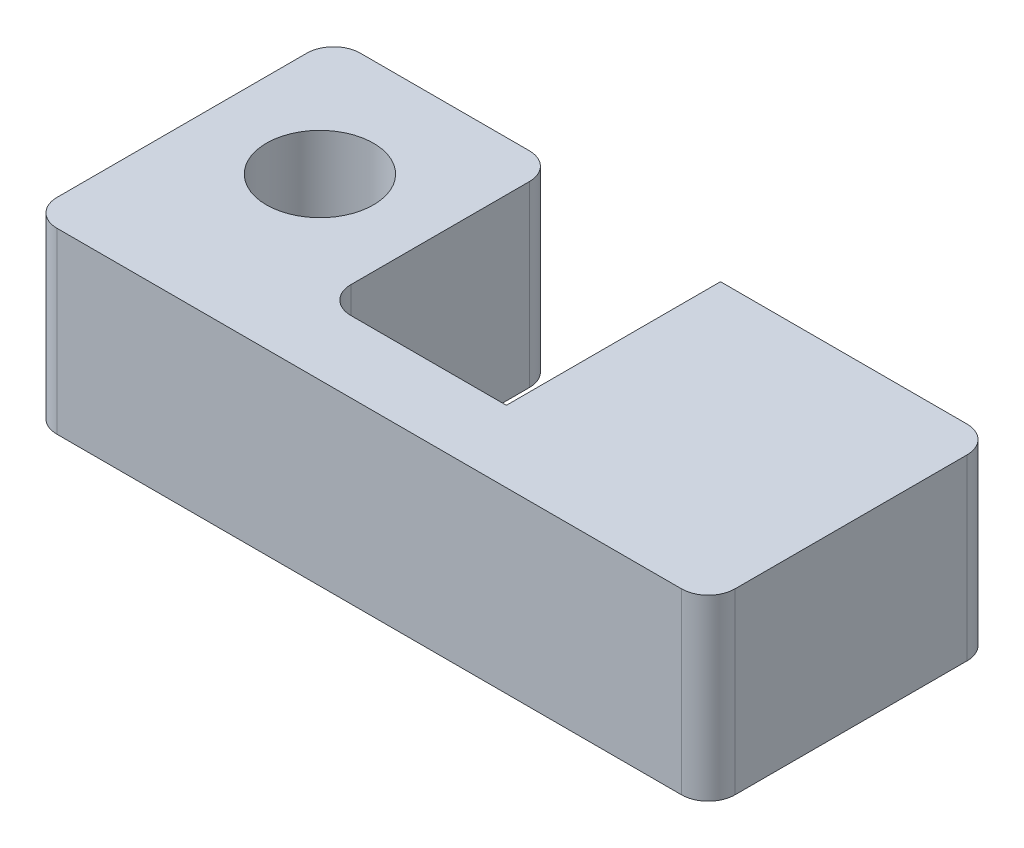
ISO-10303-21;
HEADER;
FILE_DESCRIPTION(('STEP AP214'),'2;1');
FILE_NAME('part.step','',(''),(''),'','','');
FILE_SCHEMA(('AUTOMOTIVE_DESIGN { 1 0 10303 214 1 1 1 1 }'));
ENDSEC;
DATA;
#1=APPLICATION_CONTEXT('core data for automotive mechanical design processes');
#2=APPLICATION_PROTOCOL_DEFINITION('international standard','automotive_design',2000,#1);
#3=PRODUCT_CONTEXT('',#1,'mechanical');
#4=PRODUCT('Part','Part','',(#3));
#5=PRODUCT_RELATED_PRODUCT_CATEGORY('part','',(#4));
#6=PRODUCT_DEFINITION_FORMATION('','',#4);
#7=PRODUCT_DEFINITION_CONTEXT('part definition',#1,'design');
#8=PRODUCT_DEFINITION('design','',#6,#7);
#9=PRODUCT_DEFINITION_SHAPE('','',#8);
#10=(LENGTH_UNIT() NAMED_UNIT(*) SI_UNIT(.MILLI.,.METRE.));
#11=(NAMED_UNIT(*) PLANE_ANGLE_UNIT() SI_UNIT($,.RADIAN.));
#12=(NAMED_UNIT(*) SI_UNIT($,.STERADIAN.) SOLID_ANGLE_UNIT());
#13=UNCERTAINTY_MEASURE_WITH_UNIT(LENGTH_MEASURE(1.E-05),#10,'distance_accuracy_value','');
#14=(GEOMETRIC_REPRESENTATION_CONTEXT(3) GLOBAL_UNCERTAINTY_ASSIGNED_CONTEXT((#13)) GLOBAL_UNIT_ASSIGNED_CONTEXT((#10,
#11,#12)) REPRESENTATION_CONTEXT('',''));
#15=CARTESIAN_POINT('',(0.,0.,0.));
#16=DIRECTION('',(0.,0.,1.));
#17=DIRECTION('',(1.,0.,0.));
#18=AXIS2_PLACEMENT_3D('',#15,#16,#17);
#19=CARTESIAN_POINT('',(7.735,-10.,4.5));
#20=DIRECTION('',(0.,1.,0.));
#21=DIRECTION('',(0.,0.,1.));
#22=AXIS2_PLACEMENT_3D('',#19,#20,#21);
#23=CYLINDRICAL_SURFACE('',#22,1.5);
#24=CARTESIAN_POINT('',(7.735,0.,4.5));
#25=DIRECTION('',(0.,-1.,0.));
#26=DIRECTION('',(0.,0.,1.));
#27=AXIS2_PLACEMENT_3D('',#24,#25,#26);
#28=CIRCLE('',#27,1.5);
#29=CARTESIAN_POINT('',(7.735,0.,6.));
#30=VERTEX_POINT('',#29);
#31=CARTESIAN_POINT('',(6.235,0.,4.5));
#32=VERTEX_POINT('',#31);
#33=EDGE_CURVE('E170',#30,#32,#28,.T.);
#34=ORIENTED_EDGE('',*,*,#33,.F.);
#35=DIRECTION('',(0.,1.,0.));
#36=VECTOR('',#35,1.);
#37=CARTESIAN_POINT('',(7.735,-10.,6.));
#38=LINE('',#37,#36);
#39=CARTESIAN_POINT('',(7.735,-10.,6.));
#40=VERTEX_POINT('',#39);
#41=EDGE_CURVE('E11',#40,#30,#38,.T.);
#42=ORIENTED_EDGE('',*,*,#41,.F.);
#43=CARTESIAN_POINT('',(7.735,-10.,4.5));
#44=DIRECTION('',(0.,-1.,0.));
#45=DIRECTION('',(0.,0.,1.));
#46=AXIS2_PLACEMENT_3D('',#43,#44,#45);
#47=CIRCLE('',#46,1.5);
#48=CARTESIAN_POINT('',(6.235,-10.,4.5));
#49=VERTEX_POINT('',#48);
#50=EDGE_CURVE('E209',#40,#49,#47,.T.);
#51=ORIENTED_EDGE('',*,*,#50,.T.);
#52=DIRECTION('',(0.,1.,0.));
#53=VECTOR('',#52,1.);
#54=CARTESIAN_POINT('',(6.235,-10.,4.5));
#55=LINE('',#54,#53);
#56=EDGE_CURVE('E34',#49,#32,#55,.T.);
#57=ORIENTED_EDGE('',*,*,#56,.T.);
#58=EDGE_LOOP('',(#34,#42,#51,#57));
#59=FACE_BOUND('',#58,.T.);
#60=ADVANCED_FACE('F31',(#59),#23,.F.);
#61=CARTESIAN_POINT('',(7.735,-10.,6.));
#62=DIRECTION('',(0.,0.,-1.));
#63=DIRECTION('',(-1.,0.,0.));
#64=AXIS2_PLACEMENT_3D('',#61,#62,#63);
#65=PLANE('',#64);
#66=DIRECTION('',(-1.,0.,0.));
#67=VECTOR('',#66,1.);
#68=CARTESIAN_POINT('',(7.735,0.,6.));
#69=LINE('',#68,#67);
#70=CARTESIAN_POINT('',(16.45,0.,6.));
#71=VERTEX_POINT('',#70);
#72=EDGE_CURVE('E207',#71,#30,#69,.T.);
#73=ORIENTED_EDGE('',*,*,#72,.F.);
#74=DIRECTION('',(0.,1.,0.));
#75=VECTOR('',#74,1.);
#76=CARTESIAN_POINT('',(16.45,-10.,6.));
#77=LINE('',#76,#75);
#78=CARTESIAN_POINT('',(16.45,-0.999999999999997,6.));
#79=VERTEX_POINT('',#78);
#80=EDGE_CURVE('E39',#79,#71,#77,.T.);
#81=ORIENTED_EDGE('',*,*,#80,.F.);
#82=DIRECTION('',(-0.788800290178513,0.614649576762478,0.));
#83=VECTOR('',#82,1.);
#84=CARTESIAN_POINT('',(16.45,-1.,6.));
#85=LINE('',#84,#83);
#86=CARTESIAN_POINT('',(28.,-10.,6.));
#87=VERTEX_POINT('',#86);
#88=EDGE_CURVE('E237',#87,#79,#85,.T.);
#89=ORIENTED_EDGE('',*,*,#88,.F.);
#90=DIRECTION('',(-1.,0.,0.));
#91=VECTOR('',#90,1.);
#92=CARTESIAN_POINT('',(7.735,-10.,6.));
#93=LINE('',#92,#91);
#94=EDGE_CURVE('E47',#87,#40,#93,.T.);
#95=ORIENTED_EDGE('',*,*,#94,.T.);
#96=ORIENTED_EDGE('',*,*,#41,.T.);
#97=EDGE_LOOP('',(#73,#81,#89,#95,#96));
#98=FACE_BOUND('',#97,.T.);
#99=ADVANCED_FACE('F234',(#98),#65,.T.);
#100=CARTESIAN_POINT('',(16.45,-10.,6.));
#101=DIRECTION('',(-1.,0.,0.));
#102=DIRECTION('',(0.,0.,1.));
#103=AXIS2_PLACEMENT_3D('',#100,#101,#102);
#104=PLANE('',#103);
#105=DIRECTION('',(0.,0.,-1.));
#106=VECTOR('',#105,1.);
#107=CARTESIAN_POINT('',(16.45,-1.,20.6424895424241));
#108=LINE('',#107,#106);
#109=CARTESIAN_POINT('',(16.45,-1.,-6.));
#110=VERTEX_POINT('',#109);
#111=EDGE_CURVE('E246',#79,#110,#108,.T.);
#112=ORIENTED_EDGE('',*,*,#111,.F.);
#113=ORIENTED_EDGE('',*,*,#80,.T.);
#114=DIRECTION('',(0.,0.,1.));
#115=VECTOR('',#114,1.);
#116=CARTESIAN_POINT('',(16.45,0.,6.));
#117=LINE('',#116,#115);
#118=CARTESIAN_POINT('',(16.45,0.,-6.));
#119=VERTEX_POINT('',#118);
#120=EDGE_CURVE('E204',#119,#71,#117,.T.);
#121=ORIENTED_EDGE('',*,*,#120,.F.);
#122=DIRECTION('',(0.,1.,0.));
#123=VECTOR('',#122,1.);
#124=CARTESIAN_POINT('',(16.45,-10.,-6.));
#125=LINE('',#124,#123);
#126=EDGE_CURVE('E212',#110,#119,#125,.T.);
#127=ORIENTED_EDGE('',*,*,#126,.F.);
#128=EDGE_LOOP('',(#112,#113,#121,#127));
#129=FACE_BOUND('',#128,.T.);
#130=ADVANCED_FACE('F243',(#129),#104,.T.);
#131=CARTESIAN_POINT('',(16.45,-10.,-6.));
#132=DIRECTION('',(0.,0.,-1.));
#133=DIRECTION('',(-1.,0.,0.));
#134=AXIS2_PLACEMENT_3D('',#131,#132,#133);
#135=PLANE('',#134);
#136=DIRECTION('',(0.788800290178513,-0.614649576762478,0.));
#137=VECTOR('',#136,1.);
#138=CARTESIAN_POINT('',(20.8135218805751,-4.40014691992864,-6.));
#139=LINE('',#138,#137);
#140=CARTESIAN_POINT('',(28.,-10.,-6.));
#141=VERTEX_POINT('',#140);
#142=EDGE_CURVE('E255',#110,#141,#139,.T.);
#143=ORIENTED_EDGE('',*,*,#142,.F.);
#144=ORIENTED_EDGE('',*,*,#126,.T.);
#145=DIRECTION('',(-1.,0.,0.));
#146=VECTOR('',#145,1.);
#147=CARTESIAN_POINT('',(16.45,0.,-6.));
#148=LINE('',#147,#146);
#149=CARTESIAN_POINT('',(30.265,0.,-6.));
#150=VERTEX_POINT('',#149);
#151=EDGE_CURVE('E201',#150,#119,#148,.T.);
#152=ORIENTED_EDGE('',*,*,#151,.F.);
#153=DIRECTION('',(0.,1.,0.));
#154=VECTOR('',#153,1.);
#155=CARTESIAN_POINT('',(30.265,-10.,-6.));
#156=LINE('',#155,#154);
#157=CARTESIAN_POINT('',(30.265,-10.,-6.));
#158=VERTEX_POINT('',#157);
#159=EDGE_CURVE('E149',#158,#150,#156,.T.);
#160=ORIENTED_EDGE('',*,*,#159,.F.);
#161=DIRECTION('',(-1.,0.,0.));
#162=VECTOR('',#161,1.);
#163=CARTESIAN_POINT('',(16.45,-10.,-6.));
#164=LINE('',#163,#162);
#165=EDGE_CURVE('E159',#158,#141,#164,.T.);
#166=ORIENTED_EDGE('',*,*,#165,.T.);
#167=EDGE_LOOP('',(#143,#144,#152,#160,#166));
#168=FACE_BOUND('',#167,.T.);
#169=ADVANCED_FACE('F322',(#168),#135,.T.);
#170=CARTESIAN_POINT('',(30.265,-10.,-4.5));
#171=DIRECTION('',(0.,1.,0.));
#172=DIRECTION('',(0.,0.,1.));
#173=AXIS2_PLACEMENT_3D('',#170,#171,#172);
#174=CYLINDRICAL_SURFACE('',#173,1.5);
#175=CARTESIAN_POINT('',(30.265,0.,-4.5));
#176=DIRECTION('',(0.,1.,0.));
#177=DIRECTION('',(0.,0.,-1.));
#178=AXIS2_PLACEMENT_3D('',#175,#176,#177);
#179=CIRCLE('',#178,1.5);
#180=CARTESIAN_POINT('',(31.765,0.,-4.5));
#181=VERTEX_POINT('',#180);
#182=EDGE_CURVE('E144',#181,#150,#179,.T.);
#183=ORIENTED_EDGE('',*,*,#182,.F.);
#184=DIRECTION('',(0.,1.,0.));
#185=VECTOR('',#184,1.);
#186=CARTESIAN_POINT('',(31.765,-10.,-4.5));
#187=LINE('',#186,#185);
#188=CARTESIAN_POINT('',(31.765,-10.,-4.5));
#189=VERTEX_POINT('',#188);
#190=EDGE_CURVE('E139',#189,#181,#187,.T.);
#191=ORIENTED_EDGE('',*,*,#190,.F.);
#192=CARTESIAN_POINT('',(30.265,-10.,-4.5));
#193=DIRECTION('',(0.,1.,0.));
#194=DIRECTION('',(0.,0.,-1.));
#195=AXIS2_PLACEMENT_3D('',#192,#193,#194);
#196=CIRCLE('',#195,1.5);
#197=EDGE_CURVE('E142',#189,#158,#196,.T.);
#198=ORIENTED_EDGE('',*,*,#197,.T.);
#199=ORIENTED_EDGE('',*,*,#159,.T.);
#200=EDGE_LOOP('',(#183,#191,#198,#199));
#201=FACE_BOUND('',#200,.T.);
#202=ADVANCED_FACE('F141',(#201),#174,.T.);
#203=CARTESIAN_POINT('',(31.765,-10.,-4.5));
#204=DIRECTION('',(1.,0.,0.));
#205=DIRECTION('',(0.,0.,-1.));
#206=AXIS2_PLACEMENT_3D('',#203,#204,#205);
#207=PLANE('',#206);
#208=DIRECTION('',(0.,0.,-1.));
#209=VECTOR('',#208,1.);
#210=CARTESIAN_POINT('',(31.765,0.,-4.5));
#211=LINE('',#210,#209);
#212=CARTESIAN_POINT('',(31.765,0.,8.49999999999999));
#213=VERTEX_POINT('',#212);
#214=EDGE_CURVE('E198',#213,#181,#211,.T.);
#215=ORIENTED_EDGE('',*,*,#214,.F.);
#216=DIRECTION('',(0.,1.,0.));
#217=VECTOR('',#216,1.);
#218=CARTESIAN_POINT('',(31.765,-10.,8.49999999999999));
#219=LINE('',#218,#217);
#220=CARTESIAN_POINT('',(31.765,-10.,8.49999999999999));
#221=VERTEX_POINT('',#220);
#222=EDGE_CURVE('E150',#221,#213,#219,.T.);
#223=ORIENTED_EDGE('',*,*,#222,.F.);
#224=DIRECTION('',(0.,0.,-1.));
#225=VECTOR('',#224,1.);
#226=CARTESIAN_POINT('',(31.765,-10.,-4.5));
#227=LINE('',#226,#225);
#228=EDGE_CURVE('E156',#221,#189,#227,.T.);
#229=ORIENTED_EDGE('',*,*,#228,.T.);
#230=ORIENTED_EDGE('',*,*,#190,.T.);
#231=EDGE_LOOP('',(#215,#223,#229,#230));
#232=FACE_BOUND('',#231,.T.);
#233=ADVANCED_FACE('F161',(#232),#207,.T.);
#234=CARTESIAN_POINT('',(30.265,-10.,8.49999999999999));
#235=DIRECTION('',(0.,1.,0.));
#236=DIRECTION('',(0.,0.,1.));
#237=AXIS2_PLACEMENT_3D('',#234,#235,#236);
#238=CYLINDRICAL_SURFACE('',#237,1.5);
#239=CARTESIAN_POINT('',(30.265,0.,8.49999999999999));
#240=DIRECTION('',(0.,1.,0.));
#241=DIRECTION('',(0.,0.,-1.));
#242=AXIS2_PLACEMENT_3D('',#239,#240,#241);
#243=CIRCLE('',#242,1.5);
#244=CARTESIAN_POINT('',(30.265,0.,9.99999999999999));
#245=VERTEX_POINT('',#244);
#246=EDGE_CURVE('E195',#245,#213,#243,.T.);
#247=ORIENTED_EDGE('',*,*,#246,.F.);
#248=DIRECTION('',(0.,1.,0.));
#249=VECTOR('',#248,1.);
#250=CARTESIAN_POINT('',(30.265,-10.,9.99999999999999));
#251=LINE('',#250,#249);
#252=CARTESIAN_POINT('',(30.265,-10.,9.99999999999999));
#253=VERTEX_POINT('',#252);
#254=EDGE_CURVE('E216',#253,#245,#251,.T.);
#255=ORIENTED_EDGE('',*,*,#254,.F.);
#256=CARTESIAN_POINT('',(30.265,-10.,8.49999999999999));
#257=DIRECTION('',(0.,1.,0.));
#258=DIRECTION('',(0.,0.,-1.));
#259=AXIS2_PLACEMENT_3D('',#256,#257,#258);
#260=CIRCLE('',#259,1.5);
#261=EDGE_CURVE('E162',#253,#221,#260,.T.);
#262=ORIENTED_EDGE('',*,*,#261,.T.);
#263=ORIENTED_EDGE('',*,*,#222,.T.);
#264=EDGE_LOOP('',(#247,#255,#262,#263));
#265=FACE_BOUND('',#264,.T.);
#266=ADVANCED_FACE('F305',(#265),#238,.T.);
#267=CARTESIAN_POINT('',(30.265,-10.,9.99999999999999));
#268=DIRECTION('',(0.,0.,1.));
#269=DIRECTION('',(1.,0.,0.));
#270=AXIS2_PLACEMENT_3D('',#267,#268,#269);
#271=PLANE('',#270);
#272=DIRECTION('',(1.,0.,0.));
#273=VECTOR('',#272,1.);
#274=CARTESIAN_POINT('',(30.265,0.,9.99999999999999));
#275=LINE('',#274,#273);
#276=CARTESIAN_POINT('',(-4.735,0.,10.));
#277=VERTEX_POINT('',#276);
#278=EDGE_CURVE('E192',#277,#245,#275,.T.);
#279=ORIENTED_EDGE('',*,*,#278,.F.);
#280=DIRECTION('',(0.,1.,0.));
#281=VECTOR('',#280,1.);
#282=CARTESIAN_POINT('',(-4.735,-10.,10.));
#283=LINE('',#282,#281);
#284=CARTESIAN_POINT('',(-4.735,-10.,10.));
#285=VERTEX_POINT('',#284);
#286=EDGE_CURVE('E218',#285,#277,#283,.T.);
#287=ORIENTED_EDGE('',*,*,#286,.F.);
#288=DIRECTION('',(1.,0.,0.));
#289=VECTOR('',#288,1.);
#290=CARTESIAN_POINT('',(30.265,-10.,9.99999999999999));
#291=LINE('',#290,#289);
#292=EDGE_CURVE('E164',#285,#253,#291,.T.);
#293=ORIENTED_EDGE('',*,*,#292,.T.);
#294=ORIENTED_EDGE('',*,*,#254,.T.);
#295=EDGE_LOOP('',(#279,#287,#293,#294));
#296=FACE_BOUND('',#295,.T.);
#297=ADVANCED_FACE('F283',(#296),#271,.T.);
#298=CARTESIAN_POINT('',(-4.735,-10.,8.5));
#299=DIRECTION('',(0.,1.,0.));
#300=DIRECTION('',(0.,0.,1.));
#301=AXIS2_PLACEMENT_3D('',#298,#299,#300);
#302=CYLINDRICAL_SURFACE('',#301,1.5);
#303=CARTESIAN_POINT('',(-4.735,0.,8.5));
#304=DIRECTION('',(0.,1.,0.));
#305=DIRECTION('',(0.,0.,-1.));
#306=AXIS2_PLACEMENT_3D('',#303,#304,#305);
#307=CIRCLE('',#306,1.5);
#308=CARTESIAN_POINT('',(-6.235,0.,8.5));
#309=VERTEX_POINT('',#308);
#310=EDGE_CURVE('E189',#309,#277,#307,.T.);
#311=ORIENTED_EDGE('',*,*,#310,.F.);
#312=DIRECTION('',(0.,1.,0.));
#313=VECTOR('',#312,1.);
#314=CARTESIAN_POINT('',(-6.235,-10.,8.5));
#315=LINE('',#314,#313);
#316=CARTESIAN_POINT('',(-6.235,-10.,8.5));
#317=VERTEX_POINT('',#316);
#318=EDGE_CURVE('E220',#317,#309,#315,.T.);
#319=ORIENTED_EDGE('',*,*,#318,.F.);
#320=CARTESIAN_POINT('',(-4.735,-10.,8.5));
#321=DIRECTION('',(0.,1.,0.));
#322=DIRECTION('',(0.,0.,-1.));
#323=AXIS2_PLACEMENT_3D('',#320,#321,#322);
#324=CIRCLE('',#323,1.5);
#325=EDGE_CURVE('E277',#317,#285,#324,.T.);
#326=ORIENTED_EDGE('',*,*,#325,.T.);
#327=ORIENTED_EDGE('',*,*,#286,.T.);
#328=EDGE_LOOP('',(#311,#319,#326,#327));
#329=FACE_BOUND('',#328,.T.);
#330=ADVANCED_FACE('F289',(#329),#302,.T.);
#331=CARTESIAN_POINT('',(-6.235,-10.,-5.5));
#332=DIRECTION('',(-1.,0.,0.));
#333=DIRECTION('',(0.,0.,1.));
#334=AXIS2_PLACEMENT_3D('',#331,#332,#333);
#335=PLANE('',#334);
#336=DIRECTION('',(0.,0.,1.));
#337=VECTOR('',#336,1.);
#338=CARTESIAN_POINT('',(-6.235,0.,-5.5));
#339=LINE('',#338,#337);
#340=CARTESIAN_POINT('',(-6.235,0.,-5.5));
#341=VERTEX_POINT('',#340);
#342=EDGE_CURVE('E186',#341,#309,#339,.T.);
#343=ORIENTED_EDGE('',*,*,#342,.F.);
#344=DIRECTION('',(0.,1.,0.));
#345=VECTOR('',#344,1.);
#346=CARTESIAN_POINT('',(-6.235,-10.,-5.5));
#347=LINE('',#346,#345);
#348=CARTESIAN_POINT('',(-6.235,-10.,-5.5));
#349=VERTEX_POINT('',#348);
#350=EDGE_CURVE('E222',#349,#341,#347,.T.);
#351=ORIENTED_EDGE('',*,*,#350,.F.);
#352=DIRECTION('',(0.,0.,1.));
#353=VECTOR('',#352,1.);
#354=CARTESIAN_POINT('',(-6.235,-10.,-5.5));
#355=LINE('',#354,#353);
#356=EDGE_CURVE('E274',#349,#317,#355,.T.);
#357=ORIENTED_EDGE('',*,*,#356,.T.);
#358=ORIENTED_EDGE('',*,*,#318,.T.);
#359=EDGE_LOOP('',(#343,#351,#357,#358));
#360=FACE_BOUND('',#359,.T.);
#361=ADVANCED_FACE('F292',(#360),#335,.T.);
#362=CARTESIAN_POINT('',(-4.735,-10.,-5.5));
#363=DIRECTION('',(0.,1.,0.));
#364=DIRECTION('',(0.,0.,1.));
#365=AXIS2_PLACEMENT_3D('',#362,#363,#364);
#366=CYLINDRICAL_SURFACE('',#365,1.5);
#367=CARTESIAN_POINT('',(-4.735,0.,-5.5));
#368=DIRECTION('',(0.,1.,0.));
#369=DIRECTION('',(0.,0.,1.));
#370=AXIS2_PLACEMENT_3D('',#367,#368,#369);
#371=CIRCLE('',#370,1.5);
#372=CARTESIAN_POINT('',(-4.73499999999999,0.,-7.));
#373=VERTEX_POINT('',#372);
#374=EDGE_CURVE('E183',#373,#341,#371,.T.);
#375=ORIENTED_EDGE('',*,*,#374,.F.);
#376=DIRECTION('',(0.,1.,0.));
#377=VECTOR('',#376,1.);
#378=CARTESIAN_POINT('',(-4.73499999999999,-10.,-7.));
#379=LINE('',#378,#377);
#380=CARTESIAN_POINT('',(-4.73499999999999,-10.,-7.));
#381=VERTEX_POINT('',#380);
#382=EDGE_CURVE('E224',#381,#373,#379,.T.);
#383=ORIENTED_EDGE('',*,*,#382,.F.);
#384=CARTESIAN_POINT('',(-4.735,-10.,-5.5));
#385=DIRECTION('',(0.,1.,0.));
#386=DIRECTION('',(0.,0.,1.));
#387=AXIS2_PLACEMENT_3D('',#384,#385,#386);
#388=CIRCLE('',#387,1.5);
#389=EDGE_CURVE('E271',#381,#349,#388,.T.);
#390=ORIENTED_EDGE('',*,*,#389,.T.);
#391=ORIENTED_EDGE('',*,*,#350,.T.);
#392=EDGE_LOOP('',(#375,#383,#390,#391));
#393=FACE_BOUND('',#392,.T.);
#394=ADVANCED_FACE('F297',(#393),#366,.T.);
#395=CARTESIAN_POINT('',(4.735,-10.,-7.));
#396=DIRECTION('',(0.,0.,-1.));
#397=DIRECTION('',(-1.,0.,0.));
#398=AXIS2_PLACEMENT_3D('',#395,#396,#397);
#399=PLANE('',#398);
#400=DIRECTION('',(-1.,0.,0.));
#401=VECTOR('',#400,1.);
#402=CARTESIAN_POINT('',(4.735,0.,-7.));
#403=LINE('',#402,#401);
#404=CARTESIAN_POINT('',(4.735,0.,-7.));
#405=VERTEX_POINT('',#404);
#406=EDGE_CURVE('E180',#405,#373,#403,.T.);
#407=ORIENTED_EDGE('',*,*,#406,.F.);
#408=DIRECTION('',(0.,1.,0.));
#409=VECTOR('',#408,1.);
#410=CARTESIAN_POINT('',(4.735,-10.,-7.));
#411=LINE('',#410,#409);
#412=CARTESIAN_POINT('',(4.735,-10.,-7.));
#413=VERTEX_POINT('',#412);
#414=EDGE_CURVE('E226',#413,#405,#411,.T.);
#415=ORIENTED_EDGE('',*,*,#414,.F.);
#416=DIRECTION('',(-1.,0.,0.));
#417=VECTOR('',#416,1.);
#418=CARTESIAN_POINT('',(4.735,-10.,-7.));
#419=LINE('',#418,#417);
#420=EDGE_CURVE('E268',#413,#381,#419,.T.);
#421=ORIENTED_EDGE('',*,*,#420,.T.);
#422=ORIENTED_EDGE('',*,*,#382,.T.);
#423=EDGE_LOOP('',(#407,#415,#421,#422));
#424=FACE_BOUND('',#423,.T.);
#425=ADVANCED_FACE('F300',(#424),#399,.T.);
#426=CARTESIAN_POINT('',(4.735,-10.,-5.5));
#427=DIRECTION('',(0.,1.,0.));
#428=DIRECTION('',(0.,0.,1.));
#429=AXIS2_PLACEMENT_3D('',#426,#427,#428);
#430=CYLINDRICAL_SURFACE('',#429,1.5);
#431=CARTESIAN_POINT('',(4.735,0.,-5.5));
#432=DIRECTION('',(0.,1.,0.));
#433=DIRECTION('',(0.,0.,1.));
#434=AXIS2_PLACEMENT_3D('',#431,#432,#433);
#435=CIRCLE('',#434,1.5);
#436=CARTESIAN_POINT('',(6.235,0.,-5.5));
#437=VERTEX_POINT('',#436);
#438=EDGE_CURVE('E177',#437,#405,#435,.T.);
#439=ORIENTED_EDGE('',*,*,#438,.F.);
#440=DIRECTION('',(0.,1.,0.));
#441=VECTOR('',#440,1.);
#442=CARTESIAN_POINT('',(6.235,-10.,-5.5));
#443=LINE('',#442,#441);
#444=CARTESIAN_POINT('',(6.235,-10.,-5.5));
#445=VERTEX_POINT('',#444);
#446=EDGE_CURVE('E227',#445,#437,#443,.T.);
#447=ORIENTED_EDGE('',*,*,#446,.F.);
#448=CARTESIAN_POINT('',(4.735,-10.,-5.5));
#449=DIRECTION('',(0.,1.,0.));
#450=DIRECTION('',(0.,0.,1.));
#451=AXIS2_PLACEMENT_3D('',#448,#449,#450);
#452=CIRCLE('',#451,1.5);
#453=EDGE_CURVE('E265',#445,#413,#452,.T.);
#454=ORIENTED_EDGE('',*,*,#453,.T.);
#455=ORIENTED_EDGE('',*,*,#414,.T.);
#456=EDGE_LOOP('',(#439,#447,#454,#455));
#457=FACE_BOUND('',#456,.T.);
#458=ADVANCED_FACE('F303',(#457),#430,.T.);
#459=CARTESIAN_POINT('',(6.235,-10.,-5.5));
#460=DIRECTION('',(1.,0.,0.));
#461=DIRECTION('',(0.,0.,-1.));
#462=AXIS2_PLACEMENT_3D('',#459,#460,#461);
#463=PLANE('',#462);
#464=DIRECTION('',(0.,0.,-1.));
#465=VECTOR('',#464,1.);
#466=CARTESIAN_POINT('',(6.235,0.,-5.5));
#467=LINE('',#466,#465);
#468=EDGE_CURVE('E173',#32,#437,#467,.T.);
#469=ORIENTED_EDGE('',*,*,#468,.F.);
#470=ORIENTED_EDGE('',*,*,#56,.F.);
#471=DIRECTION('',(0.,0.,-1.));
#472=VECTOR('',#471,1.);
#473=CARTESIAN_POINT('',(6.235,-10.,-5.5));
#474=LINE('',#473,#472);
#475=EDGE_CURVE('E263',#49,#445,#474,.T.);
#476=ORIENTED_EDGE('',*,*,#475,.T.);
#477=ORIENTED_EDGE('',*,*,#446,.T.);
#478=EDGE_LOOP('',(#469,#470,#476,#477));
#479=FACE_BOUND('',#478,.T.);
#480=ADVANCED_FACE('F229',(#479),#463,.T.);
#481=CARTESIAN_POINT('',(7.735,-10.,4.5));
#482=DIRECTION('',(0.,1.,0.));
#483=DIRECTION('',(0.,0.,1.));
#484=AXIS2_PLACEMENT_3D('',#481,#482,#483);
#485=PLANE('',#484);
#486=CARTESIAN_POINT('',(0.,-10.,0.));
#487=DIRECTION('',(0.,1.,0.));
#488=DIRECTION('',(0.,0.,1.));
#489=AXIS2_PLACEMENT_3D('',#486,#487,#488);
#490=CIRCLE('',#489,3.);
#491=CARTESIAN_POINT('',(0.,-10.,3.));
#492=VERTEX_POINT('',#491);
#493=EDGE_CURVE('E174',#492,#492,#490,.T.);
#494=ORIENTED_EDGE('',*,*,#493,.T.);
#495=EDGE_LOOP('',(#494));
#496=FACE_BOUND('',#495,.T.);
#497=ORIENTED_EDGE('',*,*,#94,.F.);
#498=DIRECTION('',(0.,0.,-1.));
#499=VECTOR('',#498,1.);
#500=CARTESIAN_POINT('',(28.,-10.,20.6424895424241));
#501=LINE('',#500,#499);
#502=EDGE_CURVE('E250',#87,#141,#501,.T.);
#503=ORIENTED_EDGE('',*,*,#502,.T.);
#504=ORIENTED_EDGE('',*,*,#165,.F.);
#505=ORIENTED_EDGE('',*,*,#197,.F.);
#506=ORIENTED_EDGE('',*,*,#228,.F.);
#507=ORIENTED_EDGE('',*,*,#261,.F.);
#508=ORIENTED_EDGE('',*,*,#292,.F.);
#509=ORIENTED_EDGE('',*,*,#325,.F.);
#510=ORIENTED_EDGE('',*,*,#356,.F.);
#511=ORIENTED_EDGE('',*,*,#389,.F.);
#512=ORIENTED_EDGE('',*,*,#420,.F.);
#513=ORIENTED_EDGE('',*,*,#453,.F.);
#514=ORIENTED_EDGE('',*,*,#475,.F.);
#515=ORIENTED_EDGE('',*,*,#50,.F.);
#516=EDGE_LOOP('',(#497,#503,#504,#505,#506,#507,#508,#509,#510,#511,#512,#513,#514,#515));
#517=FACE_BOUND('',#516,.T.);
#518=ADVANCED_FACE('F154',(#496,#517),#485,.F.);
#519=CARTESIAN_POINT('',(7.735,0.,4.5));
#520=DIRECTION('',(0.,1.,0.));
#521=DIRECTION('',(0.,0.,1.));
#522=AXIS2_PLACEMENT_3D('',#519,#520,#521);
#523=PLANE('',#522);
#524=CARTESIAN_POINT('',(0.,0.,0.));
#525=DIRECTION('',(0.,1.,0.));
#526=DIRECTION('',(0.,0.,1.));
#527=AXIS2_PLACEMENT_3D('',#524,#525,#526);
#528=CIRCLE('',#527,3.);
#529=CARTESIAN_POINT('',(0.,0.,3.));
#530=VERTEX_POINT('',#529);
#531=EDGE_CURVE('E257',#530,#530,#528,.T.);
#532=ORIENTED_EDGE('',*,*,#531,.F.);
#533=EDGE_LOOP('',(#532));
#534=FACE_BOUND('',#533,.T.);
#535=ORIENTED_EDGE('',*,*,#33,.T.);
#536=ORIENTED_EDGE('',*,*,#468,.T.);
#537=ORIENTED_EDGE('',*,*,#438,.T.);
#538=ORIENTED_EDGE('',*,*,#406,.T.);
#539=ORIENTED_EDGE('',*,*,#374,.T.);
#540=ORIENTED_EDGE('',*,*,#342,.T.);
#541=ORIENTED_EDGE('',*,*,#310,.T.);
#542=ORIENTED_EDGE('',*,*,#278,.T.);
#543=ORIENTED_EDGE('',*,*,#246,.T.);
#544=ORIENTED_EDGE('',*,*,#214,.T.);
#545=ORIENTED_EDGE('',*,*,#182,.T.);
#546=ORIENTED_EDGE('',*,*,#151,.T.);
#547=ORIENTED_EDGE('',*,*,#120,.T.);
#548=ORIENTED_EDGE('',*,*,#72,.T.);
#549=EDGE_LOOP('',(#535,#536,#537,#538,#539,#540,#541,#542,#543,#544,#545,#546,#547,#548));
#550=FACE_BOUND('',#549,.T.);
#551=ADVANCED_FACE('F231',(#534,#550),#523,.T.);
#552=CARTESIAN_POINT('',(0.,-10.,0.));
#553=DIRECTION('',(0.,1.,0.));
#554=DIRECTION('',(0.,0.,1.));
#555=AXIS2_PLACEMENT_3D('',#552,#553,#554);
#556=CYLINDRICAL_SURFACE('',#555,3.);
#557=ORIENTED_EDGE('',*,*,#493,.F.);
#558=EDGE_LOOP('',(#557));
#559=FACE_BOUND('',#558,.T.);
#560=ORIENTED_EDGE('',*,*,#531,.T.);
#561=EDGE_LOOP('',(#560));
#562=FACE_BOUND('',#561,.T.);
#563=ADVANCED_FACE('F407',(#559,#562),#556,.F.);
#564=CARTESIAN_POINT('',(16.45,-1.,20.6424895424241));
#565=DIRECTION('',(0.614649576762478,0.788800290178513,0.));
#566=DIRECTION('',(-0.788800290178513,0.614649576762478,0.));
#567=AXIS2_PLACEMENT_3D('',#564,#565,#566);
#568=PLANE('',#567);
#569=ORIENTED_EDGE('',*,*,#142,.T.);
#570=ORIENTED_EDGE('',*,*,#502,.F.);
#571=ORIENTED_EDGE('',*,*,#88,.T.);
#572=ORIENTED_EDGE('',*,*,#111,.T.);
#573=EDGE_LOOP('',(#569,#570,#571,#572));
#574=FACE_BOUND('',#573,.T.);
#575=ADVANCED_FACE('F415',(#574),#568,.F.);
#576=CLOSED_SHELL('',(#60,#99,#130,#169,#202,#233,#266,#297,#330,#361,#394,#425,#458,#480,#518,
#551,#563,#575));
#577=MANIFOLD_SOLID_BREP('B2',#576);
#578=ADVANCED_BREP_SHAPE_REPRESENTATION('',(#18,#577),#14);
#579=SHAPE_DEFINITION_REPRESENTATION(#9,#578);
ENDSEC;
END-ISO-10303-21;
